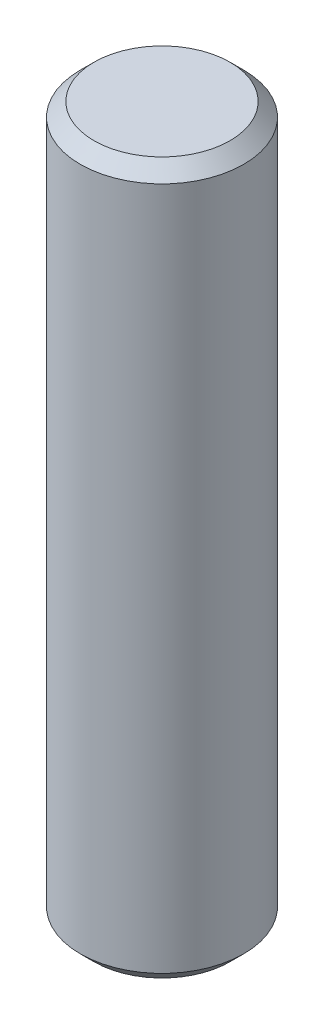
from build123d import *

# Parameters (mm, degrees)
SKETCH1_R         = 2.987
M6_TH_D_ROD_DEPTH = 26
CHAMFER1_SIZE     = 0.5


with BuildPart() as part:
    # Sketch1 → M6 th_d rod (new body)
    with BuildSketch(Plane(origin=(0, 0, 0), x_dir=(1, 0, 0), z_dir=(0, 1, 0))):
        with Locations(Location((0, 0, 0), (0, 0, 90))):
            Circle(SKETCH1_R)
    extrude(amount=M6_TH_D_ROD_DEPTH)

    # Chamfer1
    chamfer1_edges = [part.edges().sort_by_distance(p)[0] for p in [
        (0, 0, 2.987),
        (0, 26, 2.987),
    ]]
    chamfer(chamfer1_edges, length=CHAMFER1_SIZE)


solid = part.part
